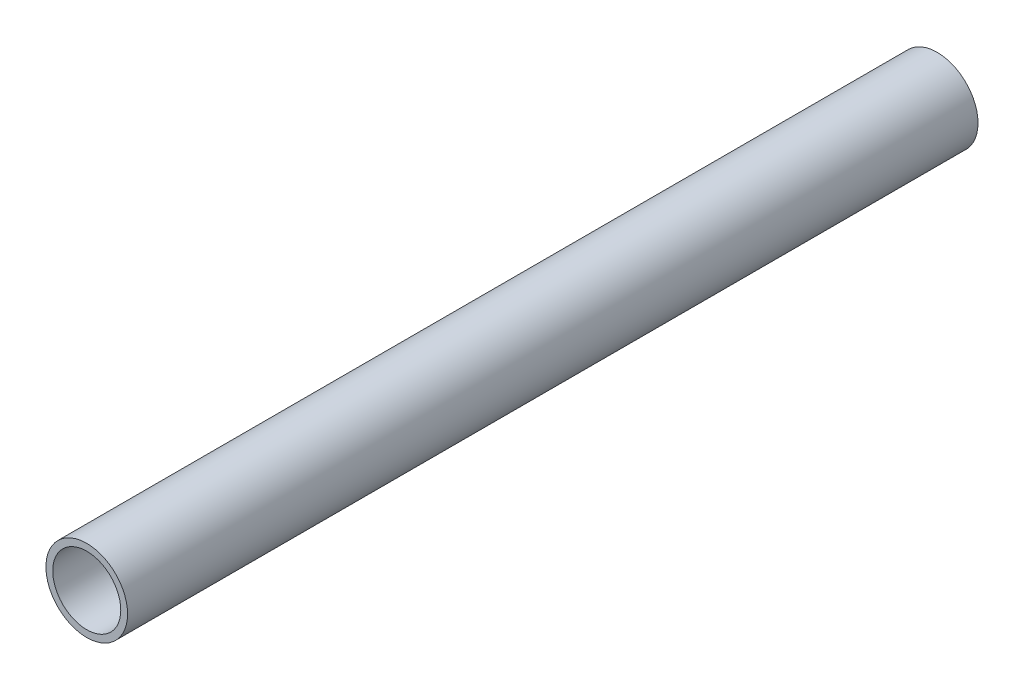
from build123d import *

# Parameters (mm, degrees)
ESQUISSE1_R      = 30
ESQUISSE1_R_2    = 25
EXTRUSION1_DEPTH = 625


with BuildPart() as part:
    # Esquisse1 → Extrusion1 (new body)
    with BuildSketch(Plane.XY):
        Circle(ESQUISSE1_R)
        Circle(ESQUISSE1_R_2, mode=Mode.SUBTRACT)
    extrude(amount=EXTRUSION1_DEPTH)


solid = part.part
